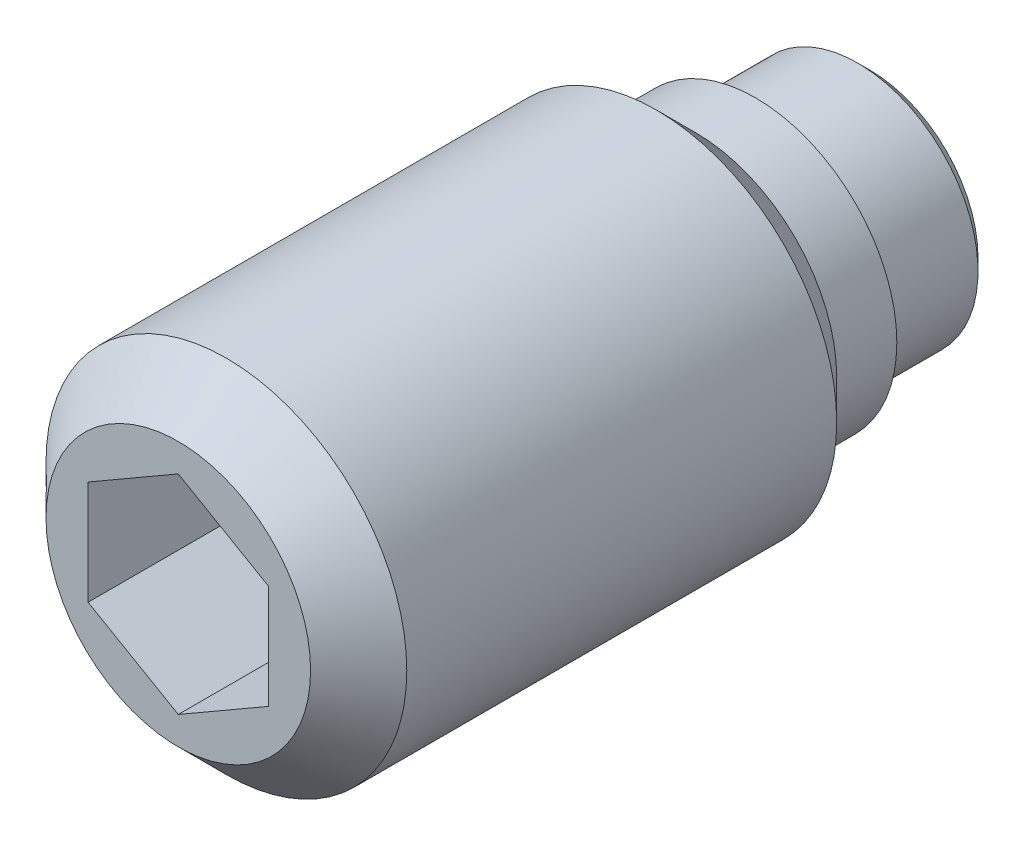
ISO-10303-21;
HEADER;
FILE_DESCRIPTION(('STEP AP214'),'2;1');
FILE_NAME('part.step','',(''),(''),'','','');
FILE_SCHEMA(('AUTOMOTIVE_DESIGN { 1 0 10303 214 1 1 1 1 }'));
ENDSEC;
DATA;
#1=APPLICATION_CONTEXT('core data for automotive mechanical design processes');
#2=APPLICATION_PROTOCOL_DEFINITION('international standard','automotive_design',2000,#1);
#3=PRODUCT_CONTEXT('',#1,'mechanical');
#4=PRODUCT('Part','Part','',(#3));
#5=PRODUCT_RELATED_PRODUCT_CATEGORY('part','',(#4));
#6=PRODUCT_DEFINITION_FORMATION('','',#4);
#7=PRODUCT_DEFINITION_CONTEXT('part definition',#1,'design');
#8=PRODUCT_DEFINITION('design','',#6,#7);
#9=PRODUCT_DEFINITION_SHAPE('','',#8);
#10=(LENGTH_UNIT() NAMED_UNIT(*) SI_UNIT(.MILLI.,.METRE.));
#11=(NAMED_UNIT(*) PLANE_ANGLE_UNIT() SI_UNIT($,.RADIAN.));
#12=(NAMED_UNIT(*) SI_UNIT($,.STERADIAN.) SOLID_ANGLE_UNIT());
#13=UNCERTAINTY_MEASURE_WITH_UNIT(LENGTH_MEASURE(1.E-05),#10,'distance_accuracy_value','');
#14=(GEOMETRIC_REPRESENTATION_CONTEXT(3) GLOBAL_UNCERTAINTY_ASSIGNED_CONTEXT((#13)) GLOBAL_UNIT_ASSIGNED_CONTEXT((#10,
#11,#12)) REPRESENTATION_CONTEXT('',''));
#15=CARTESIAN_POINT('',(0.,0.,0.));
#16=DIRECTION('',(0.,0.,1.));
#17=DIRECTION('',(1.,0.,0.));
#18=AXIS2_PLACEMENT_3D('',#15,#16,#17);
#19=CARTESIAN_POINT('',(0.,0.,1.9));
#20=DIRECTION('',(0.,0.,-1.));
#21=DIRECTION('',(-1.,0.,0.));
#22=AXIS2_PLACEMENT_3D('',#19,#20,#21);
#23=CYLINDRICAL_SURFACE('',#22,3.);
#24=CARTESIAN_POINT('',(0.,0.,3.55));
#25=DIRECTION('',(0.,0.,-1.));
#26=DIRECTION('',(-1.,0.,0.));
#27=AXIS2_PLACEMENT_3D('',#24,#25,#26);
#28=CIRCLE('',#27,3.);
#29=CARTESIAN_POINT('',(-3.,0.,3.55));
#30=VERTEX_POINT('',#29);
#31=EDGE_CURVE('E9',#30,#30,#28,.T.);
#32=ORIENTED_EDGE('',*,*,#31,.F.);
#33=EDGE_LOOP('',(#32));
#34=FACE_BOUND('',#33,.T.);
#35=CARTESIAN_POINT('',(0.,0.,10.7));
#36=DIRECTION('',(0.,0.,1.));
#37=DIRECTION('',(1.,0.,0.));
#38=AXIS2_PLACEMENT_3D('',#35,#36,#37);
#39=CIRCLE('',#38,3.);
#40=CARTESIAN_POINT('',(3.,0.,10.7));
#41=VERTEX_POINT('',#40);
#42=EDGE_CURVE('E123',#41,#41,#39,.T.);
#43=ORIENTED_EDGE('',*,*,#42,.F.);
#44=EDGE_LOOP('',(#43));
#45=FACE_BOUND('',#44,.T.);
#46=ADVANCED_FACE('F14',(#34,#45),#23,.T.);
#47=CARTESIAN_POINT('',(0.,0.,3.55));
#48=DIRECTION('',(0.,0.,1.));
#49=DIRECTION('',(1.,0.,0.));
#50=AXIS2_PLACEMENT_3D('',#47,#48,#49);
#51=CONICAL_SURFACE('',#50,3.,0.785398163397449);
#52=ORIENTED_EDGE('',*,*,#31,.T.);
#53=EDGE_LOOP('',(#52));
#54=FACE_BOUND('',#53,.T.);
#55=CARTESIAN_POINT('',(0.,0.,2.9));
#56=DIRECTION('',(0.,0.,-1.));
#57=DIRECTION('',(-1.,0.,0.));
#58=AXIS2_PLACEMENT_3D('',#55,#56,#57);
#59=CIRCLE('',#58,2.35);
#60=CARTESIAN_POINT('',(-2.35,0.,2.9));
#61=VERTEX_POINT('',#60);
#62=EDGE_CURVE('E21',#61,#61,#59,.T.);
#63=ORIENTED_EDGE('',*,*,#62,.F.);
#64=EDGE_LOOP('',(#63));
#65=FACE_BOUND('',#64,.T.);
#66=ADVANCED_FACE('F143',(#54,#65),#51,.T.);
#67=CARTESIAN_POINT('',(0.,0.,1.9));
#68=DIRECTION('',(0.,0.,-1.));
#69=DIRECTION('',(-1.,0.,0.));
#70=AXIS2_PLACEMENT_3D('',#67,#68,#69);
#71=CYLINDRICAL_SURFACE('',#70,2.35);
#72=ORIENTED_EDGE('',*,*,#62,.T.);
#73=EDGE_LOOP('',(#72));
#74=FACE_BOUND('',#73,.T.);
#75=CARTESIAN_POINT('',(0.,0.,1.9));
#76=DIRECTION('',(0.,0.,-1.));
#77=DIRECTION('',(-1.,0.,0.));
#78=AXIS2_PLACEMENT_3D('',#75,#76,#77);
#79=CIRCLE('',#78,2.35);
#80=CARTESIAN_POINT('',(-2.35,0.,1.9));
#81=VERTEX_POINT('',#80);
#82=EDGE_CURVE('E135',#81,#81,#79,.T.);
#83=ORIENTED_EDGE('',*,*,#82,.F.);
#84=EDGE_LOOP('',(#83));
#85=FACE_BOUND('',#84,.T.);
#86=ADVANCED_FACE('F140',(#74,#85),#71,.T.);
#87=CARTESIAN_POINT('',(0.,2.35,1.9));
#88=DIRECTION('',(0.,0.,1.));
#89=DIRECTION('',(1.,0.,0.));
#90=AXIS2_PLACEMENT_3D('',#87,#88,#89);
#91=PLANE('',#90);
#92=ORIENTED_EDGE('',*,*,#82,.T.);
#93=EDGE_LOOP('',(#92));
#94=FACE_BOUND('',#93,.T.);
#95=CARTESIAN_POINT('',(0.,0.,1.9));
#96=DIRECTION('',(0.,0.,-1.));
#97=DIRECTION('',(-1.,0.,0.));
#98=AXIS2_PLACEMENT_3D('',#95,#96,#97);
#99=CIRCLE('',#98,2.);
#100=CARTESIAN_POINT('',(-2.,0.,1.9));
#101=VERTEX_POINT('',#100);
#102=EDGE_CURVE('E132',#101,#101,#99,.T.);
#103=ORIENTED_EDGE('',*,*,#102,.F.);
#104=EDGE_LOOP('',(#103));
#105=FACE_BOUND('',#104,.T.);
#106=ADVANCED_FACE('F151',(#94,#105),#91,.F.);
#107=CARTESIAN_POINT('',(0.,0.,0.));
#108=DIRECTION('',(0.,0.,-1.));
#109=DIRECTION('',(-1.,0.,0.));
#110=AXIS2_PLACEMENT_3D('',#107,#108,#109);
#111=CYLINDRICAL_SURFACE('',#110,2.);
#112=CARTESIAN_POINT('',(0.,0.,0.2));
#113=DIRECTION('',(0.,0.,-1.));
#114=DIRECTION('',(-1.,0.,0.));
#115=AXIS2_PLACEMENT_3D('',#112,#113,#114);
#116=CIRCLE('',#115,2.);
#117=CARTESIAN_POINT('',(-2.,0.,0.2));
#118=VERTEX_POINT('',#117);
#119=EDGE_CURVE('E129',#118,#118,#116,.T.);
#120=ORIENTED_EDGE('',*,*,#119,.F.);
#121=EDGE_LOOP('',(#120));
#122=FACE_BOUND('',#121,.T.);
#123=ORIENTED_EDGE('',*,*,#102,.T.);
#124=EDGE_LOOP('',(#123));
#125=FACE_BOUND('',#124,.T.);
#126=ADVANCED_FACE('F157',(#122,#125),#111,.T.);
#127=CARTESIAN_POINT('',(0.,0.,0.2));
#128=DIRECTION('',(0.,0.,1.));
#129=DIRECTION('',(1.,0.,0.));
#130=AXIS2_PLACEMENT_3D('',#127,#128,#129);
#131=CONICAL_SURFACE('',#130,2.,0.785398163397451);
#132=CARTESIAN_POINT('',(0.,0.,0.));
#133=DIRECTION('',(0.,0.,-1.));
#134=DIRECTION('',(-1.,0.,0.));
#135=AXIS2_PLACEMENT_3D('',#132,#133,#134);
#136=CIRCLE('',#135,1.8);
#137=CARTESIAN_POINT('',(-1.8,0.,0.));
#138=VERTEX_POINT('',#137);
#139=EDGE_CURVE('E126',#138,#138,#136,.T.);
#140=ORIENTED_EDGE('',*,*,#139,.F.);
#141=EDGE_LOOP('',(#140));
#142=FACE_BOUND('',#141,.T.);
#143=ORIENTED_EDGE('',*,*,#119,.T.);
#144=EDGE_LOOP('',(#143));
#145=FACE_BOUND('',#144,.T.);
#146=ADVANCED_FACE('F161',(#142,#145),#131,.T.);
#147=CARTESIAN_POINT('',(0.,1.8,0.));
#148=DIRECTION('',(0.,0.,1.));
#149=DIRECTION('',(1.,0.,0.));
#150=AXIS2_PLACEMENT_3D('',#147,#148,#149);
#151=PLANE('',#150);
#152=ORIENTED_EDGE('',*,*,#139,.T.);
#153=EDGE_LOOP('',(#152));
#154=FACE_BOUND('',#153,.T.);
#155=ADVANCED_FACE('F165',(#154),#151,.F.);
#156=CARTESIAN_POINT('',(0.,0.,11.5));
#157=DIRECTION('',(0.,0.,-1.));
#158=DIRECTION('',(-1.,0.,0.));
#159=AXIS2_PLACEMENT_3D('',#156,#157,#158);
#160=CONICAL_SURFACE('',#159,2.2,0.785398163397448);
#161=ORIENTED_EDGE('',*,*,#42,.T.);
#162=EDGE_LOOP('',(#161));
#163=FACE_BOUND('',#162,.T.);
#164=CARTESIAN_POINT('',(0.,0.,11.5));
#165=DIRECTION('',(0.,0.,1.));
#166=DIRECTION('',(1.,0.,0.));
#167=AXIS2_PLACEMENT_3D('',#164,#165,#166);
#168=CIRCLE('',#167,2.2);
#169=CARTESIAN_POINT('',(2.2,0.,11.5));
#170=VERTEX_POINT('',#169);
#171=EDGE_CURVE('E115',#170,#170,#168,.T.);
#172=ORIENTED_EDGE('',*,*,#171,.F.);
#173=EDGE_LOOP('',(#172));
#174=FACE_BOUND('',#173,.T.);
#175=ADVANCED_FACE('F169',(#163,#174),#160,.T.);
#176=CARTESIAN_POINT('',(0.,0.,11.5));
#177=DIRECTION('',(0.,0.,1.));
#178=DIRECTION('',(1.,0.,0.));
#179=AXIS2_PLACEMENT_3D('',#176,#177,#178);
#180=PLANE('',#179);
#181=DIRECTION('',(0.866025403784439,-0.5,0.));
#182=VECTOR('',#181,1.);
#183=CARTESIAN_POINT('',(-1.5,-0.866025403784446,11.5));
#184=LINE('',#183,#182);
#185=CARTESIAN_POINT('',(-1.5,-0.866025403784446,11.5));
#186=VERTEX_POINT('',#185);
#187=CARTESIAN_POINT('',(0.,-1.73205080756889,11.5));
#188=VERTEX_POINT('',#187);
#189=EDGE_CURVE('E28',#186,#188,#184,.T.);
#190=ORIENTED_EDGE('',*,*,#189,.F.);
#191=DIRECTION('',(0.,-1.,0.));
#192=VECTOR('',#191,1.);
#193=CARTESIAN_POINT('',(-1.5,0.866025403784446,11.5));
#194=LINE('',#193,#192);
#195=CARTESIAN_POINT('',(-1.5,0.866025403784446,11.5));
#196=VERTEX_POINT('',#195);
#197=EDGE_CURVE('E111',#196,#186,#194,.T.);
#198=ORIENTED_EDGE('',*,*,#197,.F.);
#199=DIRECTION('',(-0.866025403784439,-0.5,0.));
#200=VECTOR('',#199,1.);
#201=CARTESIAN_POINT('',(0.,1.73205080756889,11.5));
#202=LINE('',#201,#200);
#203=CARTESIAN_POINT('',(0.,1.73205080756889,11.5));
#204=VERTEX_POINT('',#203);
#205=EDGE_CURVE('E109',#204,#196,#202,.T.);
#206=ORIENTED_EDGE('',*,*,#205,.F.);
#207=DIRECTION('',(-0.866025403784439,0.5,0.));
#208=VECTOR('',#207,1.);
#209=CARTESIAN_POINT('',(1.5,0.866025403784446,11.5));
#210=LINE('',#209,#208);
#211=CARTESIAN_POINT('',(1.5,0.866025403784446,11.5));
#212=VERTEX_POINT('',#211);
#213=EDGE_CURVE('E76',#212,#204,#210,.T.);
#214=ORIENTED_EDGE('',*,*,#213,.F.);
#215=DIRECTION('',(0.,1.,0.));
#216=VECTOR('',#215,1.);
#217=CARTESIAN_POINT('',(1.5,-0.866025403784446,11.5));
#218=LINE('',#217,#216);
#219=CARTESIAN_POINT('',(1.5,-0.866025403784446,11.5));
#220=VERTEX_POINT('',#219);
#221=EDGE_CURVE('E105',#220,#212,#218,.T.);
#222=ORIENTED_EDGE('',*,*,#221,.F.);
#223=DIRECTION('',(0.866025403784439,0.5,0.));
#224=VECTOR('',#223,1.);
#225=CARTESIAN_POINT('',(0.,-1.73205080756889,11.5));
#226=LINE('',#225,#224);
#227=EDGE_CURVE('E102',#188,#220,#226,.T.);
#228=ORIENTED_EDGE('',*,*,#227,.F.);
#229=EDGE_LOOP('',(#190,#198,#206,#214,#222,#228));
#230=FACE_BOUND('',#229,.T.);
#231=ORIENTED_EDGE('',*,*,#171,.T.);
#232=EDGE_LOOP('',(#231));
#233=FACE_BOUND('',#232,.T.);
#234=ADVANCED_FACE('F173',(#230,#233),#180,.T.);
#235=CARTESIAN_POINT('',(-1.5,-0.866025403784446,8.));
#236=DIRECTION('',(-0.5,-0.866025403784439,0.));
#237=DIRECTION('',(0.866025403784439,-0.5,0.));
#238=AXIS2_PLACEMENT_3D('',#235,#236,#237);
#239=PLANE('',#238);
#240=ORIENTED_EDGE('',*,*,#189,.T.);
#241=DIRECTION('',(0.,0.,1.));
#242=VECTOR('',#241,1.);
#243=CARTESIAN_POINT('',(0.,-1.73205080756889,8.));
#244=LINE('',#243,#242);
#245=CARTESIAN_POINT('',(0.,-1.73205080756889,8.));
#246=VERTEX_POINT('',#245);
#247=EDGE_CURVE('E58',#246,#188,#244,.T.);
#248=ORIENTED_EDGE('',*,*,#247,.F.);
#249=DIRECTION('',(0.866025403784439,-0.5,0.));
#250=VECTOR('',#249,1.);
#251=CARTESIAN_POINT('',(-1.5,-0.866025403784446,8.));
#252=LINE('',#251,#250);
#253=CARTESIAN_POINT('',(-1.5,-0.866025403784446,8.));
#254=VERTEX_POINT('',#253);
#255=EDGE_CURVE('E113',#254,#246,#252,.T.);
#256=ORIENTED_EDGE('',*,*,#255,.F.);
#257=DIRECTION('',(0.,0.,1.));
#258=VECTOR('',#257,1.);
#259=CARTESIAN_POINT('',(-1.5,-0.866025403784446,8.));
#260=LINE('',#259,#258);
#261=EDGE_CURVE('E36',#254,#186,#260,.T.);
#262=ORIENTED_EDGE('',*,*,#261,.T.);
#263=EDGE_LOOP('',(#240,#248,#256,#262));
#264=FACE_BOUND('',#263,.T.);
#265=ADVANCED_FACE('F177',(#264),#239,.F.);
#266=CARTESIAN_POINT('',(-1.5,0.866025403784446,8.));
#267=DIRECTION('',(-1.,0.,0.));
#268=DIRECTION('',(0.,0.,1.));
#269=AXIS2_PLACEMENT_3D('',#266,#267,#268);
#270=PLANE('',#269);
#271=ORIENTED_EDGE('',*,*,#197,.T.);
#272=ORIENTED_EDGE('',*,*,#261,.F.);
#273=DIRECTION('',(0.,-1.,0.));
#274=VECTOR('',#273,1.);
#275=CARTESIAN_POINT('',(-1.5,0.866025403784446,8.));
#276=LINE('',#275,#274);
#277=CARTESIAN_POINT('',(-1.5,0.866025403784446,8.));
#278=VERTEX_POINT('',#277);
#279=EDGE_CURVE('E88',#278,#254,#276,.T.);
#280=ORIENTED_EDGE('',*,*,#279,.F.);
#281=DIRECTION('',(0.,0.,1.));
#282=VECTOR('',#281,1.);
#283=CARTESIAN_POINT('',(-1.5,0.866025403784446,8.));
#284=LINE('',#283,#282);
#285=EDGE_CURVE('E80',#278,#196,#284,.T.);
#286=ORIENTED_EDGE('',*,*,#285,.T.);
#287=EDGE_LOOP('',(#271,#272,#280,#286));
#288=FACE_BOUND('',#287,.T.);
#289=ADVANCED_FACE('F181',(#288),#270,.F.);
#290=CARTESIAN_POINT('',(0.,1.73205080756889,8.));
#291=DIRECTION('',(-0.5,0.866025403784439,0.));
#292=DIRECTION('',(-0.866025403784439,-0.5,0.));
#293=AXIS2_PLACEMENT_3D('',#290,#291,#292);
#294=PLANE('',#293);
#295=ORIENTED_EDGE('',*,*,#205,.T.);
#296=ORIENTED_EDGE('',*,*,#285,.F.);
#297=DIRECTION('',(-0.866025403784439,-0.5,0.));
#298=VECTOR('',#297,1.);
#299=CARTESIAN_POINT('',(0.,1.73205080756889,8.));
#300=LINE('',#299,#298);
#301=CARTESIAN_POINT('',(0.,1.73205080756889,8.));
#302=VERTEX_POINT('',#301);
#303=EDGE_CURVE('E84',#302,#278,#300,.T.);
#304=ORIENTED_EDGE('',*,*,#303,.F.);
#305=DIRECTION('',(0.,0.,1.));
#306=VECTOR('',#305,1.);
#307=CARTESIAN_POINT('',(0.,1.73205080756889,8.));
#308=LINE('',#307,#306);
#309=EDGE_CURVE('E69',#302,#204,#308,.T.);
#310=ORIENTED_EDGE('',*,*,#309,.T.);
#311=EDGE_LOOP('',(#295,#296,#304,#310));
#312=FACE_BOUND('',#311,.T.);
#313=ADVANCED_FACE('F85',(#312),#294,.F.);
#314=CARTESIAN_POINT('',(1.5,0.866025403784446,8.));
#315=DIRECTION('',(0.5,0.866025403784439,0.));
#316=DIRECTION('',(-0.866025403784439,0.5,0.));
#317=AXIS2_PLACEMENT_3D('',#314,#315,#316);
#318=PLANE('',#317);
#319=ORIENTED_EDGE('',*,*,#213,.T.);
#320=ORIENTED_EDGE('',*,*,#309,.F.);
#321=DIRECTION('',(-0.866025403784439,0.5,0.));
#322=VECTOR('',#321,1.);
#323=CARTESIAN_POINT('',(1.5,0.866025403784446,8.));
#324=LINE('',#323,#322);
#325=CARTESIAN_POINT('',(1.5,0.866025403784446,8.));
#326=VERTEX_POINT('',#325);
#327=EDGE_CURVE('E73',#326,#302,#324,.T.);
#328=ORIENTED_EDGE('',*,*,#327,.F.);
#329=DIRECTION('',(0.,0.,1.));
#330=VECTOR('',#329,1.);
#331=CARTESIAN_POINT('',(1.5,0.866025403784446,8.));
#332=LINE('',#331,#330);
#333=EDGE_CURVE('E81',#326,#212,#332,.T.);
#334=ORIENTED_EDGE('',*,*,#333,.T.);
#335=EDGE_LOOP('',(#319,#320,#328,#334));
#336=FACE_BOUND('',#335,.T.);
#337=ADVANCED_FACE('F71',(#336),#318,.F.);
#338=CARTESIAN_POINT('',(1.5,-0.866025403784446,8.));
#339=DIRECTION('',(1.,0.,0.));
#340=DIRECTION('',(0.,0.,-1.));
#341=AXIS2_PLACEMENT_3D('',#338,#339,#340);
#342=PLANE('',#341);
#343=ORIENTED_EDGE('',*,*,#221,.T.);
#344=ORIENTED_EDGE('',*,*,#333,.F.);
#345=DIRECTION('',(0.,1.,0.));
#346=VECTOR('',#345,1.);
#347=CARTESIAN_POINT('',(1.5,-0.866025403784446,8.));
#348=LINE('',#347,#346);
#349=CARTESIAN_POINT('',(1.5,-0.866025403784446,8.));
#350=VERTEX_POINT('',#349);
#351=EDGE_CURVE('E94',#350,#326,#348,.T.);
#352=ORIENTED_EDGE('',*,*,#351,.F.);
#353=DIRECTION('',(0.,0.,1.));
#354=VECTOR('',#353,1.);
#355=CARTESIAN_POINT('',(1.5,-0.866025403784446,8.));
#356=LINE('',#355,#354);
#357=EDGE_CURVE('E118',#350,#220,#356,.T.);
#358=ORIENTED_EDGE('',*,*,#357,.T.);
#359=EDGE_LOOP('',(#343,#344,#352,#358));
#360=FACE_BOUND('',#359,.T.);
#361=ADVANCED_FACE('F185',(#360),#342,.F.);
#362=CARTESIAN_POINT('',(0.,-1.73205080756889,8.));
#363=DIRECTION('',(0.5,-0.866025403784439,0.));
#364=DIRECTION('',(0.866025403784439,0.5,0.));
#365=AXIS2_PLACEMENT_3D('',#362,#363,#364);
#366=PLANE('',#365);
#367=ORIENTED_EDGE('',*,*,#227,.T.);
#368=ORIENTED_EDGE('',*,*,#357,.F.);
#369=DIRECTION('',(0.866025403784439,0.5,0.));
#370=VECTOR('',#369,1.);
#371=CARTESIAN_POINT('',(0.,-1.73205080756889,8.));
#372=LINE('',#371,#370);
#373=EDGE_CURVE('E96',#246,#350,#372,.T.);
#374=ORIENTED_EDGE('',*,*,#373,.F.);
#375=ORIENTED_EDGE('',*,*,#247,.T.);
#376=EDGE_LOOP('',(#367,#368,#374,#375));
#377=FACE_BOUND('',#376,.T.);
#378=ADVANCED_FACE('F182',(#377),#366,.F.);
#379=CARTESIAN_POINT('',(0.,0.,8.));
#380=DIRECTION('',(0.,0.,1.));
#381=DIRECTION('',(1.,0.,0.));
#382=AXIS2_PLACEMENT_3D('',#379,#380,#381);
#383=PLANE('',#382);
#384=ORIENTED_EDGE('',*,*,#255,.T.);
#385=ORIENTED_EDGE('',*,*,#373,.T.);
#386=ORIENTED_EDGE('',*,*,#351,.T.);
#387=ORIENTED_EDGE('',*,*,#327,.T.);
#388=ORIENTED_EDGE('',*,*,#303,.T.);
#389=ORIENTED_EDGE('',*,*,#279,.T.);
#390=EDGE_LOOP('',(#384,#385,#386,#387,#388,#389));
#391=FACE_BOUND('',#390,.T.);
#392=ADVANCED_FACE('F91',(#391),#383,.T.);
#393=CLOSED_SHELL('',(#46,#66,#86,#106,#126,#146,#155,#175,#234,#265,#289,#313,#337,#361,#378,#392));
#394=MANIFOLD_SOLID_BREP('B1',#393);
#395=ADVANCED_BREP_SHAPE_REPRESENTATION('',(#18,#394),#14);
#396=SHAPE_DEFINITION_REPRESENTATION(#9,#395);
ENDSEC;
END-ISO-10303-21;
